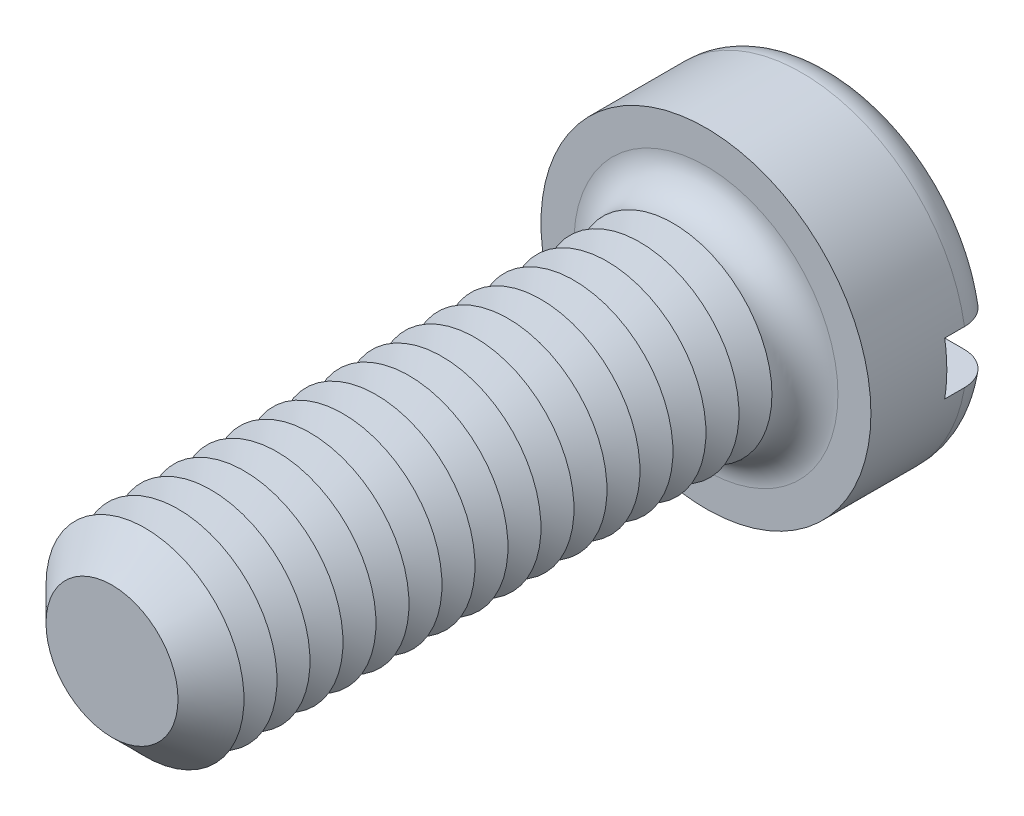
from build123d import *

# Parameters (mm, degrees)
SKETCH3_R           = 5
BOSS_EXTRUDE2_DEPTH = 3.9
SKETCH4_R           = 3
BOSS_EXTRUDE3_DEPTH = 18
FILLET1_R           = 1
CHAMFER1_SIZE       = 1
LPATTERN1_COUNT     = 16
LPATTERN1_PITCH     = 1
SKETCH8_W           = 10
SKETCH8_H           = 1.6
CUT_EXTRUDE1_DEPTH  = 1.6


with BuildPart() as part:
    # Sketch3 → Boss-Extrude2 (new body)
    with BuildSketch(Plane.XY):
        Circle(SKETCH3_R)
    extrude(amount=-BOSS_EXTRUDE2_DEPTH)

    # Sketch4 → Boss-Extrude3 (add)
    with BuildSketch(Plane.XY):
        Circle(SKETCH4_R)
    extrude(amount=BOSS_EXTRUDE3_DEPTH)

    # Fillet1
    fillet1_edges = [part.edges().sort_by_distance(p)[0] for p in [
        (-5, 0, -3.9),
        (-3, 0, 0),
    ]]
    fillet(fillet1_edges, radius=FILLET1_R)

    # Chamfer1
    chamfer1_edges = [part.edges().sort_by_distance(p)[0] for p in [
        (-3, 0, 18),
    ]]
    chamfer(chamfer1_edges, length=CHAMFER1_SIZE)

    # Sketch6 → Cut-Revolve1 (revolve, cut)
    with BuildSketch(Plane(origin=(0, 0, 0), x_dir=(0, 0, -1), z_dir=(1, 0, 0)), mode=Mode.PRIVATE) as cut_revolve1_sk:
        Polygon((-1, 3), (-1.5, 2.133974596), (-2, 3), align=None)
    cut_revolve1 = revolve(cut_revolve1_sk.sketch.rotate(Axis((0, 0, -1.694361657), (0, 0, 1)), 90), axis=Axis((0, 0, -1.694361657), (0, 0, 1)), mode=Mode.SUBTRACT)

    # LPattern1: Cut-Revolve1 ×16
    with Locations(*[(0, 0, i * LPATTERN1_PITCH) for i in range(1, LPATTERN1_COUNT)]):
        add(cut_revolve1, mode=Mode.SUBTRACT)

    # Sketch8 → Cut-Extrude1 (cut)
    with BuildSketch(Plane(origin=(0, 0, -3.9), x_dir=(-1, 0, 0), z_dir=(0, 0, -1))):
        Rectangle(SKETCH8_W, SKETCH8_H)
    extrude(amount=-CUT_EXTRUDE1_DEPTH, mode=Mode.SUBTRACT)


solid = part.part
